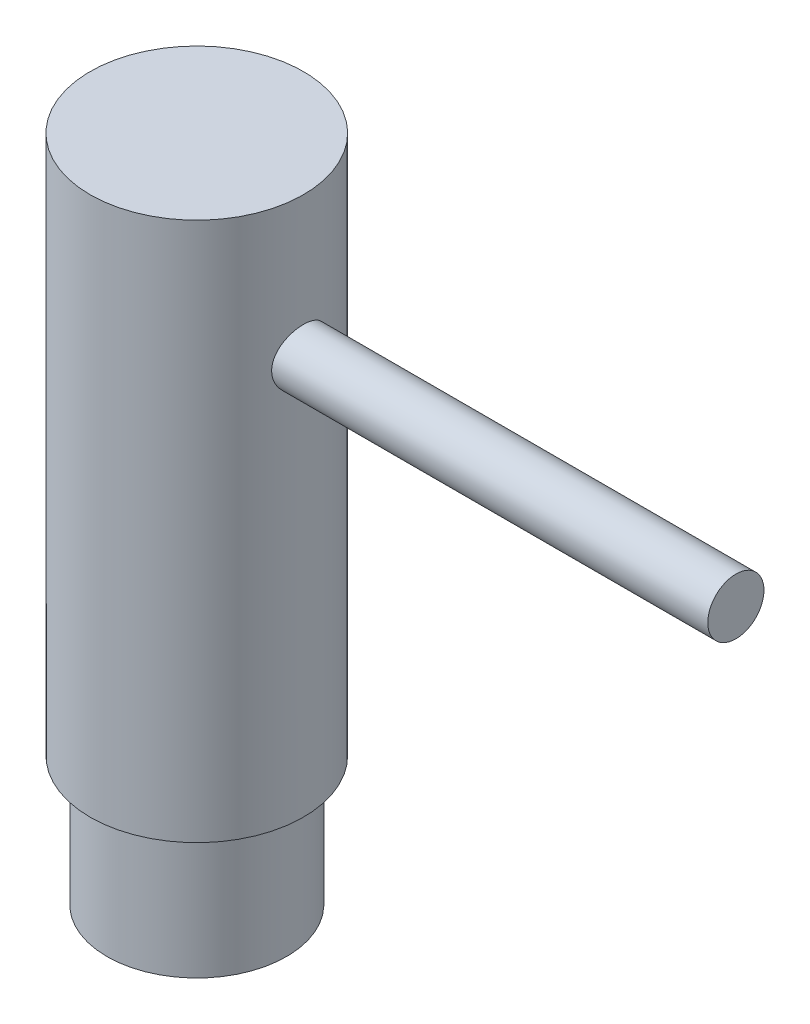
from build123d import *

# Parameters (mm, degrees)
SKETCH1_R           = 16
BOSS_EXTRUDE1_DEPTH = 23
SKETCH2_R           = 19
BOSS_EXTRUDE2_DEPTH = 96
SKETCH4_R           = 5


with BuildPart() as part:
    # Sketch1 → Boss-Extrude1 (new body)
    with BuildSketch(Plane(origin=(0, 0, 0), x_dir=(1, 0, 0), z_dir=(0, 1, 0))):
        with Locations(Location((0, 0, 0), (0, 0, 270))):
            Circle(SKETCH1_R)
    extrude(amount=BOSS_EXTRUDE1_DEPTH)

    # Sketch2 → Boss-Extrude2 (add)
    with BuildSketch(Plane(origin=(0, 23, 0), x_dir=(1, 0, 0), z_dir=(0, 1, 0))):
        with Locations(Location((0, 0, 0), (0, 0, 270))):
            Circle(SKETCH2_R)
    extrude(amount=BOSS_EXTRUDE2_DEPTH)

    # Sweep1: sweep along a path in Sketch3
    with BuildLine(Plane(origin=(0, 94, 0), x_dir=(1, 0, 0), z_dir=(0, 1, 0))) as sweep1_path:
        Line((0, 0), (96, 0))
    # Sketch4 → Sweep1 (sweep)
    with BuildSketch(Plane(origin=(0, 0, 0), x_dir=(0, 0, -1), z_dir=(1, 0, 0))):
        with Locations((0, 94)):
            Circle(SKETCH4_R)
    sweep(path=sweep1_path.line)


solid = part.part
